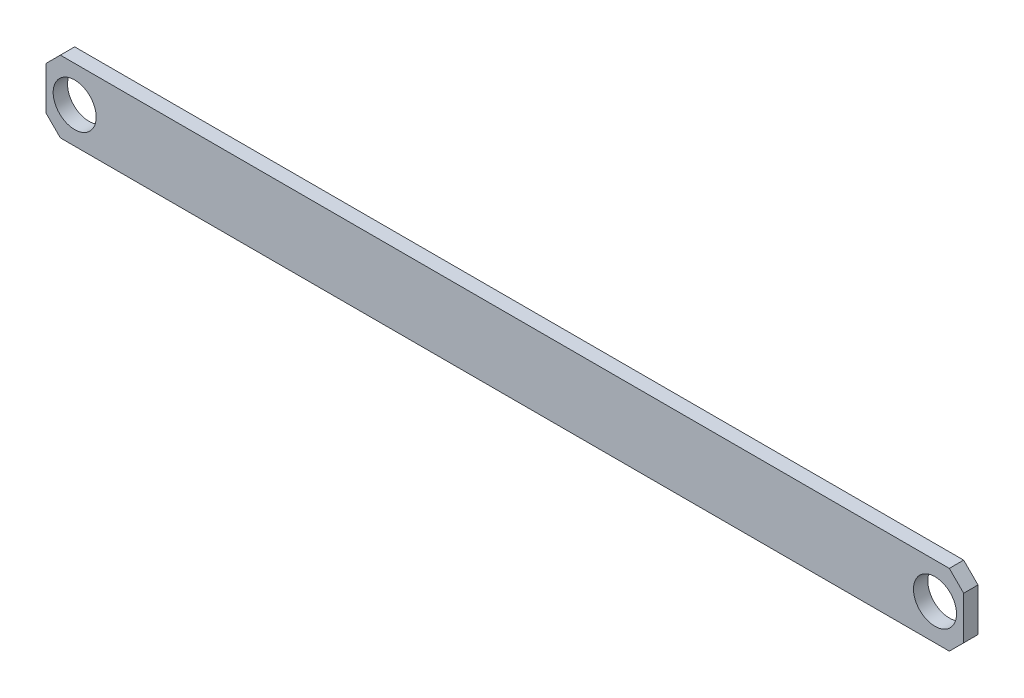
ISO-10303-21;
HEADER;
FILE_DESCRIPTION(('STEP AP214'),'2;1');
FILE_NAME('part.step','',(''),(''),'','','');
FILE_SCHEMA(('AUTOMOTIVE_DESIGN { 1 0 10303 214 1 1 1 1 }'));
ENDSEC;
DATA;
#1=APPLICATION_CONTEXT('core data for automotive mechanical design processes');
#2=APPLICATION_PROTOCOL_DEFINITION('international standard','automotive_design',2000,#1);
#3=PRODUCT_CONTEXT('',#1,'mechanical');
#4=PRODUCT('Part','Part','',(#3));
#5=PRODUCT_RELATED_PRODUCT_CATEGORY('part','',(#4));
#6=PRODUCT_DEFINITION_FORMATION('','',#4);
#7=PRODUCT_DEFINITION_CONTEXT('part definition',#1,'design');
#8=PRODUCT_DEFINITION('design','',#6,#7);
#9=PRODUCT_DEFINITION_SHAPE('','',#8);
#10=(LENGTH_UNIT() NAMED_UNIT(*) SI_UNIT(.MILLI.,.METRE.));
#11=(NAMED_UNIT(*) PLANE_ANGLE_UNIT() SI_UNIT($,.RADIAN.));
#12=(NAMED_UNIT(*) SI_UNIT($,.STERADIAN.) SOLID_ANGLE_UNIT());
#13=UNCERTAINTY_MEASURE_WITH_UNIT(LENGTH_MEASURE(1.E-05),#10,'distance_accuracy_value','');
#14=(GEOMETRIC_REPRESENTATION_CONTEXT(3) GLOBAL_UNCERTAINTY_ASSIGNED_CONTEXT((#13)) GLOBAL_UNIT_ASSIGNED_CONTEXT((#10,
#11,#12)) REPRESENTATION_CONTEXT('',''));
#15=CARTESIAN_POINT('',(0.,0.,0.));
#16=DIRECTION('',(0.,0.,1.));
#17=DIRECTION('',(1.,0.,0.));
#18=AXIS2_PLACEMENT_3D('',#15,#16,#17);
#19=CARTESIAN_POINT('',(0.,0.,3.175));
#20=DIRECTION('',(-1.,0.,0.));
#21=DIRECTION('',(0.,0.,1.));
#22=AXIS2_PLACEMENT_3D('',#19,#20,#21);
#23=PLANE('',#22);
#24=DIRECTION('',(0.,1.,0.));
#25=VECTOR('',#24,1.);
#26=CARTESIAN_POINT('',(0.,0.,3.175));
#27=LINE('',#26,#25);
#28=CARTESIAN_POINT('',(0.,3.17500000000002,3.175));
#29=VERTEX_POINT('',#28);
#30=CARTESIAN_POINT('',(0.,12.7,3.175));
#31=VERTEX_POINT('',#30);
#32=EDGE_CURVE('E166',#29,#31,#27,.T.);
#33=ORIENTED_EDGE('',*,*,#32,.T.);
#34=DIRECTION('',(0.,0.,-1.));
#35=VECTOR('',#34,1.);
#36=CARTESIAN_POINT('',(0.,12.7,0.));
#37=LINE('',#36,#35);
#38=CARTESIAN_POINT('',(0.,12.7,0.));
#39=VERTEX_POINT('',#38);
#40=EDGE_CURVE('E112',#31,#39,#37,.T.);
#41=ORIENTED_EDGE('',*,*,#40,.T.);
#42=DIRECTION('',(0.,1.,0.));
#43=VECTOR('',#42,1.);
#44=CARTESIAN_POINT('',(0.,0.,0.));
#45=LINE('',#44,#43);
#46=CARTESIAN_POINT('',(0.,3.17500000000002,0.));
#47=VERTEX_POINT('',#46);
#48=EDGE_CURVE('E105',#47,#39,#45,.T.);
#49=ORIENTED_EDGE('',*,*,#48,.F.);
#50=DIRECTION('',(0.,0.,1.));
#51=VECTOR('',#50,1.);
#52=CARTESIAN_POINT('',(0.,3.17500000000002,3.175));
#53=LINE('',#52,#51);
#54=EDGE_CURVE('E117',#47,#29,#53,.T.);
#55=ORIENTED_EDGE('',*,*,#54,.T.);
#56=EDGE_LOOP('',(#33,#41,#49,#55));
#57=FACE_BOUND('',#56,.T.);
#58=ADVANCED_FACE('F34',(#57),#23,.T.);
#59=CARTESIAN_POINT('',(0.,0.,3.175));
#60=DIRECTION('',(0.,1.,0.));
#61=DIRECTION('',(0.,0.,1.));
#62=AXIS2_PLACEMENT_3D('',#59,#60,#61);
#63=PLANE('',#62);
#64=DIRECTION('',(1.,0.,0.));
#65=VECTOR('',#64,1.);
#66=CARTESIAN_POINT('',(0.,0.,0.));
#67=LINE('',#66,#65);
#68=CARTESIAN_POINT('',(3.17500000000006,0.,0.));
#69=VERTEX_POINT('',#68);
#70=CARTESIAN_POINT('',(200.025,0.,0.));
#71=VERTEX_POINT('',#70);
#72=EDGE_CURVE('E106',#69,#71,#67,.T.);
#73=ORIENTED_EDGE('',*,*,#72,.T.);
#74=DIRECTION('',(0.,0.,1.));
#75=VECTOR('',#74,1.);
#76=CARTESIAN_POINT('',(200.025,0.,3.175));
#77=LINE('',#76,#75);
#78=CARTESIAN_POINT('',(200.025,0.,3.175));
#79=VERTEX_POINT('',#78);
#80=EDGE_CURVE('E11',#71,#79,#77,.T.);
#81=ORIENTED_EDGE('',*,*,#80,.T.);
#82=DIRECTION('',(1.,0.,0.));
#83=VECTOR('',#82,1.);
#84=CARTESIAN_POINT('',(0.,0.,3.175));
#85=LINE('',#84,#83);
#86=CARTESIAN_POINT('',(3.17500000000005,0.,3.175));
#87=VERTEX_POINT('',#86);
#88=EDGE_CURVE('E126',#87,#79,#85,.T.);
#89=ORIENTED_EDGE('',*,*,#88,.F.);
#90=DIRECTION('',(0.,0.,-1.));
#91=VECTOR('',#90,1.);
#92=CARTESIAN_POINT('',(3.17500000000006,0.,0.));
#93=LINE('',#92,#91);
#94=EDGE_CURVE('E141',#87,#69,#93,.T.);
#95=ORIENTED_EDGE('',*,*,#94,.T.);
#96=EDGE_LOOP('',(#73,#81,#89,#95));
#97=FACE_BOUND('',#96,.T.);
#98=ADVANCED_FACE('F215',(#97),#63,.F.);
#99=CARTESIAN_POINT('',(203.2,15.875,3.175));
#100=DIRECTION('',(1.,0.,0.));
#101=DIRECTION('',(0.,0.,-1.));
#102=AXIS2_PLACEMENT_3D('',#99,#100,#101);
#103=PLANE('',#102);
#104=DIRECTION('',(0.,-1.,0.));
#105=VECTOR('',#104,1.);
#106=CARTESIAN_POINT('',(203.2,15.875,0.));
#107=LINE('',#106,#105);
#108=CARTESIAN_POINT('',(203.2,12.7,0.));
#109=VERTEX_POINT('',#108);
#110=CARTESIAN_POINT('',(203.2,3.17500000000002,0.));
#111=VERTEX_POINT('',#110);
#112=EDGE_CURVE('E171',#109,#111,#107,.T.);
#113=ORIENTED_EDGE('',*,*,#112,.F.);
#114=DIRECTION('',(0.,0.,1.));
#115=VECTOR('',#114,1.);
#116=CARTESIAN_POINT('',(203.2,12.7,3.175));
#117=LINE('',#116,#115);
#118=CARTESIAN_POINT('',(203.2,12.7,3.175));
#119=VERTEX_POINT('',#118);
#120=EDGE_CURVE('E153',#109,#119,#117,.T.);
#121=ORIENTED_EDGE('',*,*,#120,.T.);
#122=DIRECTION('',(0.,-1.,0.));
#123=VECTOR('',#122,1.);
#124=CARTESIAN_POINT('',(203.2,15.875,3.175));
#125=LINE('',#124,#123);
#126=CARTESIAN_POINT('',(203.2,3.17500000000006,3.175));
#127=VERTEX_POINT('',#126);
#128=EDGE_CURVE('E129',#119,#127,#125,.T.);
#129=ORIENTED_EDGE('',*,*,#128,.T.);
#130=DIRECTION('',(0.,0.,-1.));
#131=VECTOR('',#130,1.);
#132=CARTESIAN_POINT('',(203.2,3.17500000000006,0.));
#133=LINE('',#132,#131);
#134=EDGE_CURVE('E150',#127,#111,#133,.T.);
#135=ORIENTED_EDGE('',*,*,#134,.T.);
#136=EDGE_LOOP('',(#113,#121,#129,#135));
#137=FACE_BOUND('',#136,.T.);
#138=ADVANCED_FACE('F173',(#137),#103,.T.);
#139=CARTESIAN_POINT('',(203.2,15.875,3.175));
#140=DIRECTION('',(0.,-1.,0.));
#141=DIRECTION('',(1.,0.,0.));
#142=AXIS2_PLACEMENT_3D('',#139,#140,#141);
#143=PLANE('',#142);
#144=DIRECTION('',(-1.,0.,0.));
#145=VECTOR('',#144,1.);
#146=CARTESIAN_POINT('',(203.2,15.875,3.175));
#147=LINE('',#146,#145);
#148=CARTESIAN_POINT('',(200.025,15.875,3.175));
#149=VERTEX_POINT('',#148);
#150=CARTESIAN_POINT('',(3.17500000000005,15.875,3.175));
#151=VERTEX_POINT('',#150);
#152=EDGE_CURVE('E158',#149,#151,#147,.T.);
#153=ORIENTED_EDGE('',*,*,#152,.F.);
#154=DIRECTION('',(0.,0.,-1.));
#155=VECTOR('',#154,1.);
#156=CARTESIAN_POINT('',(200.025,15.875,0.));
#157=LINE('',#156,#155);
#158=CARTESIAN_POINT('',(200.025,15.875,0.));
#159=VERTEX_POINT('',#158);
#160=EDGE_CURVE('E143',#149,#159,#157,.T.);
#161=ORIENTED_EDGE('',*,*,#160,.T.);
#162=DIRECTION('',(-1.,0.,0.));
#163=VECTOR('',#162,1.);
#164=CARTESIAN_POINT('',(203.2,15.875,0.));
#165=LINE('',#164,#163);
#166=CARTESIAN_POINT('',(3.17500000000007,15.875,0.));
#167=VERTEX_POINT('',#166);
#168=EDGE_CURVE('E120',#159,#167,#165,.T.);
#169=ORIENTED_EDGE('',*,*,#168,.T.);
#170=DIRECTION('',(0.,0.,1.));
#171=VECTOR('',#170,1.);
#172=CARTESIAN_POINT('',(3.17500000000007,15.875,3.175));
#173=LINE('',#172,#171);
#174=EDGE_CURVE('E135',#167,#151,#173,.T.);
#175=ORIENTED_EDGE('',*,*,#174,.T.);
#176=EDGE_LOOP('',(#153,#161,#169,#175));
#177=FACE_BOUND('',#176,.T.);
#178=ADVANCED_FACE('F163',(#177),#143,.F.);
#179=CARTESIAN_POINT('',(0.,0.,3.175));
#180=DIRECTION('',(0.,0.,-1.));
#181=DIRECTION('',(-1.,0.,0.));
#182=AXIS2_PLACEMENT_3D('',#179,#180,#181);
#183=PLANE('',#182);
#184=CARTESIAN_POINT('',(196.85,7.93750000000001,3.17499999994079));
#185=DIRECTION('',(0.,0.,1.));
#186=DIRECTION('',(1.,0.,0.));
#187=AXIS2_PLACEMENT_3D('',#184,#185,#186);
#188=CIRCLE('',#187,4.76250000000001);
#189=CARTESIAN_POINT('',(201.6125,7.93750000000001,3.17499999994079));
#190=VERTEX_POINT('',#189);
#191=EDGE_CURVE('E185',#190,#190,#188,.T.);
#192=ORIENTED_EDGE('',*,*,#191,.F.);
#193=EDGE_LOOP('',(#192));
#194=FACE_BOUND('',#193,.T.);
#195=CARTESIAN_POINT('',(6.35,7.9375,3.175));
#196=DIRECTION('',(0.,0.,1.));
#197=DIRECTION('',(1.,0.,0.));
#198=AXIS2_PLACEMENT_3D('',#195,#196,#197);
#199=CIRCLE('',#198,4.7625);
#200=CARTESIAN_POINT('',(11.1125,7.9375,3.175));
#201=VERTEX_POINT('',#200);
#202=EDGE_CURVE('E179',#201,#201,#199,.T.);
#203=ORIENTED_EDGE('',*,*,#202,.F.);
#204=EDGE_LOOP('',(#203));
#205=FACE_BOUND('',#204,.T.);
#206=ORIENTED_EDGE('',*,*,#128,.F.);
#207=DIRECTION('',(-0.707106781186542,0.707106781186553,0.));
#208=VECTOR('',#207,1.);
#209=CARTESIAN_POINT('',(200.025,15.875,3.175));
#210=LINE('',#209,#208);
#211=EDGE_CURVE('E42',#119,#149,#210,.T.);
#212=ORIENTED_EDGE('',*,*,#211,.T.);
#213=ORIENTED_EDGE('',*,*,#152,.T.);
#214=DIRECTION('',(-0.707106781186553,-0.707106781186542,0.));
#215=VECTOR('',#214,1.);
#216=CARTESIAN_POINT('',(0.,12.7,3.175));
#217=LINE('',#216,#215);
#218=EDGE_CURVE('E139',#151,#31,#217,.T.);
#219=ORIENTED_EDGE('',*,*,#218,.T.);
#220=ORIENTED_EDGE('',*,*,#32,.F.);
#221=DIRECTION('',(0.707106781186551,-0.707106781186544,0.));
#222=VECTOR('',#221,1.);
#223=CARTESIAN_POINT('',(3.17500000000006,0.,3.175));
#224=LINE('',#223,#222);
#225=EDGE_CURVE('E125',#29,#87,#224,.T.);
#226=ORIENTED_EDGE('',*,*,#225,.T.);
#227=ORIENTED_EDGE('',*,*,#88,.T.);
#228=DIRECTION('',(0.707106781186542,0.707106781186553,0.));
#229=VECTOR('',#228,1.);
#230=CARTESIAN_POINT('',(203.2,3.17500000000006,3.175));
#231=LINE('',#230,#229);
#232=EDGE_CURVE('E54',#79,#127,#231,.T.);
#233=ORIENTED_EDGE('',*,*,#232,.T.);
#234=EDGE_LOOP('',(#206,#212,#213,#219,#220,#226,#227,#233));
#235=FACE_BOUND('',#234,.T.);
#236=ADVANCED_FACE('F157',(#194,#205,#235),#183,.F.);
#237=CARTESIAN_POINT('',(0.,0.,0.));
#238=DIRECTION('',(0.,0.,-1.));
#239=DIRECTION('',(-1.,0.,0.));
#240=AXIS2_PLACEMENT_3D('',#237,#238,#239);
#241=PLANE('',#240);
#242=CARTESIAN_POINT('',(196.85,7.93750000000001,0.));
#243=DIRECTION('',(0.,0.,1.));
#244=DIRECTION('',(1.,0.,0.));
#245=AXIS2_PLACEMENT_3D('',#242,#243,#244);
#246=CIRCLE('',#245,4.76250000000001);
#247=CARTESIAN_POINT('',(201.6125,7.93750000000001,0.));
#248=VERTEX_POINT('',#247);
#249=EDGE_CURVE('E182',#248,#248,#246,.T.);
#250=ORIENTED_EDGE('',*,*,#249,.T.);
#251=EDGE_LOOP('',(#250));
#252=FACE_BOUND('',#251,.T.);
#253=CARTESIAN_POINT('',(6.35,7.9375,0.));
#254=DIRECTION('',(0.,0.,1.));
#255=DIRECTION('',(1.,0.,0.));
#256=AXIS2_PLACEMENT_3D('',#253,#254,#255);
#257=CIRCLE('',#256,4.7625);
#258=CARTESIAN_POINT('',(11.1125,7.9375,0.));
#259=VERTEX_POINT('',#258);
#260=EDGE_CURVE('E121',#259,#259,#257,.T.);
#261=ORIENTED_EDGE('',*,*,#260,.T.);
#262=EDGE_LOOP('',(#261));
#263=FACE_BOUND('',#262,.T.);
#264=ORIENTED_EDGE('',*,*,#168,.F.);
#265=DIRECTION('',(0.707106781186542,-0.707106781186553,0.));
#266=VECTOR('',#265,1.);
#267=CARTESIAN_POINT('',(107.950000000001,107.95,0.));
#268=LINE('',#267,#266);
#269=EDGE_CURVE('E148',#159,#109,#268,.T.);
#270=ORIENTED_EDGE('',*,*,#269,.T.);
#271=ORIENTED_EDGE('',*,*,#112,.T.);
#272=DIRECTION('',(-0.707106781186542,-0.707106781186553,0.));
#273=VECTOR('',#272,1.);
#274=CARTESIAN_POINT('',(100.012500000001,-100.0125,0.));
#275=LINE('',#274,#273);
#276=EDGE_CURVE('E146',#111,#71,#275,.T.);
#277=ORIENTED_EDGE('',*,*,#276,.T.);
#278=ORIENTED_EDGE('',*,*,#72,.F.);
#279=DIRECTION('',(-0.707106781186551,0.707106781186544,0.));
#280=VECTOR('',#279,1.);
#281=CARTESIAN_POINT('',(1.58750000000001,1.58750000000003,0.));
#282=LINE('',#281,#280);
#283=EDGE_CURVE('E100',#69,#47,#282,.T.);
#284=ORIENTED_EDGE('',*,*,#283,.T.);
#285=ORIENTED_EDGE('',*,*,#48,.T.);
#286=DIRECTION('',(0.707106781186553,0.707106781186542,0.));
#287=VECTOR('',#286,1.);
#288=CARTESIAN_POINT('',(-6.34999999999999,6.35000000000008,0.));
#289=LINE('',#288,#287);
#290=EDGE_CURVE('E111',#39,#167,#289,.T.);
#291=ORIENTED_EDGE('',*,*,#290,.T.);
#292=EDGE_LOOP('',(#264,#270,#271,#277,#278,#284,#285,#291));
#293=FACE_BOUND('',#292,.T.);
#294=ADVANCED_FACE('F103',(#252,#263,#293),#241,.T.);
#295=CARTESIAN_POINT('',(6.35,7.9375,0.));
#296=DIRECTION('',(0.,0.,1.));
#297=DIRECTION('',(1.,0.,0.));
#298=AXIS2_PLACEMENT_3D('',#295,#296,#297);
#299=CYLINDRICAL_SURFACE('',#298,4.7625);
#300=ORIENTED_EDGE('',*,*,#260,.F.);
#301=EDGE_LOOP('',(#300));
#302=FACE_BOUND('',#301,.T.);
#303=ORIENTED_EDGE('',*,*,#202,.T.);
#304=EDGE_LOOP('',(#303));
#305=FACE_BOUND('',#304,.T.);
#306=ADVANCED_FACE('F197',(#302,#305),#299,.F.);
#307=CARTESIAN_POINT('',(196.85,7.93750000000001,0.));
#308=DIRECTION('',(0.,0.,1.));
#309=DIRECTION('',(1.,0.,0.));
#310=AXIS2_PLACEMENT_3D('',#307,#308,#309);
#311=CYLINDRICAL_SURFACE('',#310,4.76250000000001);
#312=ORIENTED_EDGE('',*,*,#249,.F.);
#313=EDGE_LOOP('',(#312));
#314=FACE_BOUND('',#313,.T.);
#315=ORIENTED_EDGE('',*,*,#191,.T.);
#316=EDGE_LOOP('',(#315));
#317=FACE_BOUND('',#316,.T.);
#318=ADVANCED_FACE('F193',(#314,#317),#311,.F.);
#319=CARTESIAN_POINT('',(0.,12.7,3.175));
#320=DIRECTION('',(-0.707106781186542,0.707106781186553,0.));
#321=DIRECTION('',(-0.707106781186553,-0.707106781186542,0.));
#322=AXIS2_PLACEMENT_3D('',#319,#320,#321);
#323=PLANE('',#322);
#324=ORIENTED_EDGE('',*,*,#218,.F.);
#325=ORIENTED_EDGE('',*,*,#174,.F.);
#326=ORIENTED_EDGE('',*,*,#290,.F.);
#327=ORIENTED_EDGE('',*,*,#40,.F.);
#328=EDGE_LOOP('',(#324,#325,#326,#327));
#329=FACE_BOUND('',#328,.T.);
#330=ADVANCED_FACE('F196',(#329),#323,.T.);
#331=CARTESIAN_POINT('',(3.17500000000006,0.,3.175));
#332=DIRECTION('',(-0.707106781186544,-0.707106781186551,0.));
#333=DIRECTION('',(0.707106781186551,-0.707106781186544,0.));
#334=AXIS2_PLACEMENT_3D('',#331,#332,#333);
#335=PLANE('',#334);
#336=ORIENTED_EDGE('',*,*,#225,.F.);
#337=ORIENTED_EDGE('',*,*,#54,.F.);
#338=ORIENTED_EDGE('',*,*,#283,.F.);
#339=ORIENTED_EDGE('',*,*,#94,.F.);
#340=EDGE_LOOP('',(#336,#337,#338,#339));
#341=FACE_BOUND('',#340,.T.);
#342=ADVANCED_FACE('F124',(#341),#335,.T.);
#343=CARTESIAN_POINT('',(200.025,15.875,3.175));
#344=DIRECTION('',(0.707106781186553,0.707106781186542,0.));
#345=DIRECTION('',(-0.707106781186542,0.707106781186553,0.));
#346=AXIS2_PLACEMENT_3D('',#343,#344,#345);
#347=PLANE('',#346);
#348=ORIENTED_EDGE('',*,*,#211,.F.);
#349=ORIENTED_EDGE('',*,*,#120,.F.);
#350=ORIENTED_EDGE('',*,*,#269,.F.);
#351=ORIENTED_EDGE('',*,*,#160,.F.);
#352=EDGE_LOOP('',(#348,#349,#350,#351));
#353=FACE_BOUND('',#352,.T.);
#354=ADVANCED_FACE('F168',(#353),#347,.T.);
#355=CARTESIAN_POINT('',(203.2,3.17500000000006,3.175));
#356=DIRECTION('',(0.707106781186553,-0.707106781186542,0.));
#357=DIRECTION('',(0.707106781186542,0.707106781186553,0.));
#358=AXIS2_PLACEMENT_3D('',#355,#356,#357);
#359=PLANE('',#358);
#360=ORIENTED_EDGE('',*,*,#232,.F.);
#361=ORIENTED_EDGE('',*,*,#80,.F.);
#362=ORIENTED_EDGE('',*,*,#276,.F.);
#363=ORIENTED_EDGE('',*,*,#134,.F.);
#364=EDGE_LOOP('',(#360,#361,#362,#363));
#365=FACE_BOUND('',#364,.T.);
#366=ADVANCED_FACE('F36',(#365),#359,.T.);
#367=CLOSED_SHELL('',(#58,#98,#138,#178,#236,#294,#306,#318,#330,#342,#354,#366));
#368=MANIFOLD_SOLID_BREP('B2',#367);
#369=ADVANCED_BREP_SHAPE_REPRESENTATION('',(#18,#368),#14);
#370=SHAPE_DEFINITION_REPRESENTATION(#9,#369);
ENDSEC;
END-ISO-10303-21;
